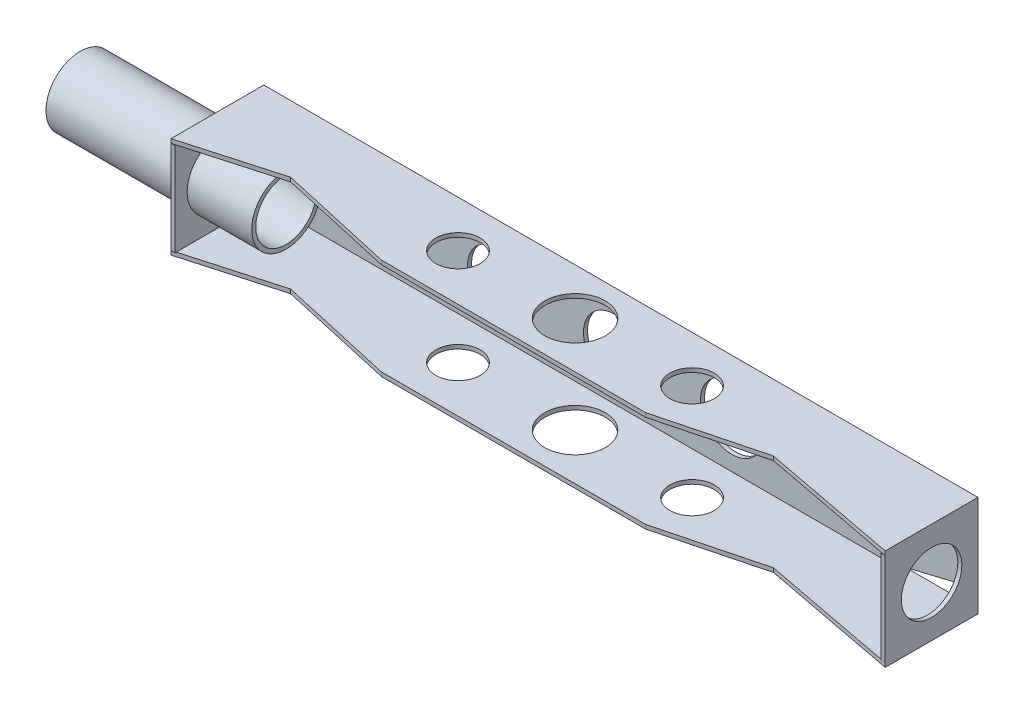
ISO-10303-21;
HEADER;
FILE_DESCRIPTION(('STEP AP214'),'2;1');
FILE_NAME('part.step','',(''),(''),'','','');
FILE_SCHEMA(('AUTOMOTIVE_DESIGN { 1 0 10303 214 1 1 1 1 }'));
ENDSEC;
DATA;
#1=APPLICATION_CONTEXT('core data for automotive mechanical design processes');
#2=APPLICATION_PROTOCOL_DEFINITION('international standard','automotive_design',2000,#1);
#3=PRODUCT_CONTEXT('',#1,'mechanical');
#4=PRODUCT('Part','Part','',(#3));
#5=PRODUCT_RELATED_PRODUCT_CATEGORY('part','',(#4));
#6=PRODUCT_DEFINITION_FORMATION('','',#4);
#7=PRODUCT_DEFINITION_CONTEXT('part definition',#1,'design');
#8=PRODUCT_DEFINITION('design','',#6,#7);
#9=PRODUCT_DEFINITION_SHAPE('','',#8);
#10=(LENGTH_UNIT() NAMED_UNIT(*) SI_UNIT(.MILLI.,.METRE.));
#11=(NAMED_UNIT(*) PLANE_ANGLE_UNIT() SI_UNIT($,.RADIAN.));
#12=(NAMED_UNIT(*) SI_UNIT($,.STERADIAN.) SOLID_ANGLE_UNIT());
#13=UNCERTAINTY_MEASURE_WITH_UNIT(LENGTH_MEASURE(1.E-05),#10,'distance_accuracy_value','');
#14=(GEOMETRIC_REPRESENTATION_CONTEXT(3) GLOBAL_UNCERTAINTY_ASSIGNED_CONTEXT((#13)) GLOBAL_UNIT_ASSIGNED_CONTEXT((#10,
#11,#12)) REPRESENTATION_CONTEXT('',''));
#15=CARTESIAN_POINT('',(0.,0.,0.));
#16=DIRECTION('',(0.,0.,1.));
#17=DIRECTION('',(1.,0.,0.));
#18=AXIS2_PLACEMENT_3D('',#15,#16,#17);
#19=CARTESIAN_POINT('',(0.,0.,0.));
#20=DIRECTION('',(-1.,0.,0.));
#21=DIRECTION('',(0.,0.,1.));
#22=AXIS2_PLACEMENT_3D('',#19,#20,#21);
#23=PLANE('',#22);
#24=DIRECTION('',(0.,-1.,0.));
#25=VECTOR('',#24,1.);
#26=CARTESIAN_POINT('',(0.,0.,2.));
#27=LINE('',#26,#25);
#28=CARTESIAN_POINT('',(0.,46.,2.));
#29=VERTEX_POINT('',#28);
#30=CARTESIAN_POINT('',(0.,0.,2.));
#31=VERTEX_POINT('',#30);
#32=EDGE_CURVE('E488',#29,#31,#27,.T.);
#33=ORIENTED_EDGE('',*,*,#32,.F.);
#34=DIRECTION('',(0.,0.,-1.));
#35=VECTOR('',#34,1.);
#36=CARTESIAN_POINT('',(0.,46.,0.));
#37=LINE('',#36,#35);
#38=CARTESIAN_POINT('',(0.,46.,45.4350722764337));
#39=VERTEX_POINT('',#38);
#40=EDGE_CURVE('E48',#39,#29,#37,.T.);
#41=ORIENTED_EDGE('',*,*,#40,.F.);
#42=DIRECTION('',(0.,0.,-1.));
#43=VECTOR('',#42,1.);
#44=CARTESIAN_POINT('',(0.,46.,0.));
#45=LINE('',#44,#43);
#46=CARTESIAN_POINT('',(0.,46.,46.));
#47=VERTEX_POINT('',#46);
#48=EDGE_CURVE('E436',#47,#39,#45,.T.);
#49=ORIENTED_EDGE('',*,*,#48,.F.);
#50=DIRECTION('',(0.,1.,0.));
#51=VECTOR('',#50,1.);
#52=CARTESIAN_POINT('',(0.,46.,46.));
#53=LINE('',#52,#51);
#54=CARTESIAN_POINT('',(0.,0.,46.));
#55=VERTEX_POINT('',#54);
#56=EDGE_CURVE('E449',#55,#47,#53,.T.);
#57=ORIENTED_EDGE('',*,*,#56,.F.);
#58=DIRECTION('',(0.,0.,1.));
#59=VECTOR('',#58,1.);
#60=CARTESIAN_POINT('',(0.,0.,0.));
#61=LINE('',#60,#59);
#62=CARTESIAN_POINT('',(0.,0.,45.4350722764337));
#63=VERTEX_POINT('',#62);
#64=EDGE_CURVE('E376',#63,#55,#61,.T.);
#65=ORIENTED_EDGE('',*,*,#64,.F.);
#66=EDGE_CURVE('E204',#31,#63,#61,.T.);
#67=ORIENTED_EDGE('',*,*,#66,.F.);
#68=EDGE_LOOP('',(#33,#41,#49,#57,#65,#67));
#69=FACE_BOUND('',#68,.T.);
#70=CARTESIAN_POINT('',(0.,23.,23.));
#71=DIRECTION('',(-1.,0.,0.));
#72=DIRECTION('',(0.,0.,1.));
#73=AXIS2_PLACEMENT_3D('',#70,#71,#72);
#74=CIRCLE('',#73,17.);
#75=CARTESIAN_POINT('',(0.,23.,40.));
#76=VERTEX_POINT('',#75);
#77=EDGE_CURVE('E41',#76,#76,#74,.F.);
#78=ORIENTED_EDGE('',*,*,#77,.F.);
#79=EDGE_LOOP('',(#78));
#80=FACE_BOUND('',#79,.T.);
#81=ADVANCED_FACE('F33',(#69,#80),#23,.F.);
#82=CARTESIAN_POINT('',(0.,0.,2.));
#83=DIRECTION('',(0.,1.,0.));
#84=DIRECTION('',(0.,0.,1.));
#85=AXIS2_PLACEMENT_3D('',#82,#83,#84);
#86=PLANE('',#85);
#87=DIRECTION('',(0.962345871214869,0.,-0.271827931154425));
#88=VECTOR('',#87,1.);
#89=CARTESIAN_POINT('',(-2.,0.,46.));
#90=LINE('',#89,#88);
#91=CARTESIAN_POINT('',(-2.,0.,46.));
#92=VERTEX_POINT('',#91);
#93=EDGE_CURVE('E207',#92,#63,#90,.T.);
#94=ORIENTED_EDGE('',*,*,#93,.T.);
#95=ORIENTED_EDGE('',*,*,#64,.T.);
#96=DIRECTION('',(1.,0.,0.));
#97=VECTOR('',#96,1.);
#98=CARTESIAN_POINT('',(-2.,0.,46.));
#99=LINE('',#98,#97);
#100=EDGE_CURVE('E450',#92,#55,#99,.T.);
#101=ORIENTED_EDGE('',*,*,#100,.F.);
#102=EDGE_LOOP('',(#94,#95,#101));
#103=FACE_BOUND('',#102,.T.);
#104=ADVANCED_FACE('F35',(#103),#86,.F.);
#105=CARTESIAN_POINT('',(352.,0.,0.));
#106=DIRECTION('',(0.,1.,0.));
#107=DIRECTION('',(0.,0.,1.));
#108=AXIS2_PLACEMENT_3D('',#105,#106,#107);
#109=PLANE('',#108);
#110=DIRECTION('',(0.982280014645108,0.,0.187419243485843));
#111=VECTOR('',#110,1.);
#112=CARTESIAN_POINT('',(352.,0.,46.));
#113=LINE('',#112,#111);
#114=CARTESIAN_POINT('',(350.,0.,45.6183995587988));
#115=VERTEX_POINT('',#114);
#116=CARTESIAN_POINT('',(352.,0.,46.));
#117=VERTEX_POINT('',#116);
#118=EDGE_CURVE('E231',#115,#117,#113,.T.);
#119=ORIENTED_EDGE('',*,*,#118,.T.);
#120=DIRECTION('',(-1.,0.,0.));
#121=VECTOR('',#120,1.);
#122=CARTESIAN_POINT('',(352.,0.,46.));
#123=LINE('',#122,#121);
#124=CARTESIAN_POINT('',(350.,0.,46.));
#125=VERTEX_POINT('',#124);
#126=EDGE_CURVE('E357',#117,#125,#123,.T.);
#127=ORIENTED_EDGE('',*,*,#126,.T.);
#128=DIRECTION('',(0.,0.,-1.));
#129=VECTOR('',#128,1.);
#130=CARTESIAN_POINT('',(350.,0.,0.));
#131=LINE('',#130,#129);
#132=EDGE_CURVE('E348',#125,#115,#131,.T.);
#133=ORIENTED_EDGE('',*,*,#132,.T.);
#134=EDGE_LOOP('',(#119,#127,#133));
#135=FACE_BOUND('',#134,.T.);
#136=ADVANCED_FACE('F396',(#135),#109,.F.);
#137=CARTESIAN_POINT('',(0.,46.,2.));
#138=DIRECTION('',(0.,-1.,0.));
#139=DIRECTION('',(0.,0.,-1.));
#140=AXIS2_PLACEMENT_3D('',#137,#138,#139);
#141=PLANE('',#140);
#142=DIRECTION('',(0.962345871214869,0.,-0.271827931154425));
#143=VECTOR('',#142,1.);
#144=CARTESIAN_POINT('',(-2.,46.,46.));
#145=LINE('',#144,#143);
#146=CARTESIAN_POINT('',(-2.,46.,46.));
#147=VERTEX_POINT('',#146);
#148=EDGE_CURVE('E310',#147,#39,#145,.T.);
#149=ORIENTED_EDGE('',*,*,#148,.F.);
#150=DIRECTION('',(1.,0.,0.));
#151=VECTOR('',#150,1.);
#152=CARTESIAN_POINT('',(-2.,46.,46.));
#153=LINE('',#152,#151);
#154=EDGE_CURVE('E435',#147,#47,#153,.T.);
#155=ORIENTED_EDGE('',*,*,#154,.T.);
#156=ORIENTED_EDGE('',*,*,#48,.T.);
#157=EDGE_LOOP('',(#149,#155,#156));
#158=FACE_BOUND('',#157,.T.);
#159=ADVANCED_FACE('F433',(#158),#141,.F.);
#160=CARTESIAN_POINT('',(352.,46.,46.));
#161=DIRECTION('',(0.,-1.,0.));
#162=DIRECTION('',(0.,0.,-1.));
#163=AXIS2_PLACEMENT_3D('',#160,#161,#162);
#164=PLANE('',#163);
#165=DIRECTION('',(0.982280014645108,0.,0.187419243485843));
#166=VECTOR('',#165,1.);
#167=CARTESIAN_POINT('',(352.,46.,46.));
#168=LINE('',#167,#166);
#169=CARTESIAN_POINT('',(350.,46.,45.6183995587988));
#170=VERTEX_POINT('',#169);
#171=CARTESIAN_POINT('',(352.,46.,46.));
#172=VERTEX_POINT('',#171);
#173=EDGE_CURVE('E56',#170,#172,#168,.T.);
#174=ORIENTED_EDGE('',*,*,#173,.F.);
#175=DIRECTION('',(0.,0.,1.));
#176=VECTOR('',#175,1.);
#177=CARTESIAN_POINT('',(350.,46.,46.));
#178=LINE('',#177,#176);
#179=CARTESIAN_POINT('',(350.,46.,46.));
#180=VERTEX_POINT('',#179);
#181=EDGE_CURVE('E372',#170,#180,#178,.T.);
#182=ORIENTED_EDGE('',*,*,#181,.T.);
#183=DIRECTION('',(-1.,0.,0.));
#184=VECTOR('',#183,1.);
#185=CARTESIAN_POINT('',(352.,46.,46.));
#186=LINE('',#185,#184);
#187=EDGE_CURVE('E373',#172,#180,#186,.T.);
#188=ORIENTED_EDGE('',*,*,#187,.F.);
#189=EDGE_LOOP('',(#174,#182,#188));
#190=FACE_BOUND('',#189,.T.);
#191=ADVANCED_FACE('F385',(#190),#164,.F.);
#192=CARTESIAN_POINT('',(0.,46.,2.));
#193=DIRECTION('',(0.,0.,-1.));
#194=DIRECTION('',(-1.,0.,0.));
#195=AXIS2_PLACEMENT_3D('',#192,#193,#194);
#196=PLANE('',#195);
#197=CARTESIAN_POINT('',(290.,23.,2.));
#198=DIRECTION('',(0.,0.,1.));
#199=DIRECTION('',(1.,0.,0.));
#200=AXIS2_PLACEMENT_3D('',#197,#198,#199);
#201=CIRCLE('',#200,9.43947184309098);
#202=CARTESIAN_POINT('',(299.439471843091,23.,2.));
#203=VERTEX_POINT('',#202);
#204=EDGE_CURVE('E620',#203,#203,#201,.T.);
#205=ORIENTED_EDGE('',*,*,#204,.F.);
#206=EDGE_LOOP('',(#205));
#207=FACE_BOUND('',#206,.T.);
#208=CARTESIAN_POINT('',(174.,23.,2.));
#209=DIRECTION('',(0.,0.,1.));
#210=DIRECTION('',(1.,0.,0.));
#211=AXIS2_PLACEMENT_3D('',#208,#209,#210);
#212=CIRCLE('',#211,15.5650293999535);
#213=CARTESIAN_POINT('',(189.565029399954,23.,2.));
#214=VERTEX_POINT('',#213);
#215=EDGE_CURVE('E630',#214,#214,#212,.T.);
#216=ORIENTED_EDGE('',*,*,#215,.F.);
#217=EDGE_LOOP('',(#216));
#218=FACE_BOUND('',#217,.T.);
#219=ORIENTED_EDGE('',*,*,#32,.T.);
#220=DIRECTION('',(1.,0.,0.));
#221=VECTOR('',#220,1.);
#222=CARTESIAN_POINT('',(0.,0.,2.));
#223=LINE('',#222,#221);
#224=CARTESIAN_POINT('',(309.788272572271,0.,2.));
#225=VERTEX_POINT('',#224);
#226=EDGE_CURVE('E485',#31,#225,#223,.T.);
#227=ORIENTED_EDGE('',*,*,#226,.T.);
#228=DIRECTION('',(0.972344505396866,0.233551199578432,0.));
#229=VECTOR('',#228,1.);
#230=CARTESIAN_POINT('',(309.788272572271,0.,2.));
#231=LINE('',#230,#229);
#232=CARTESIAN_POINT('',(350.,9.65861083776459,2.));
#233=VERTEX_POINT('',#232);
#234=EDGE_CURVE('E487',#225,#233,#231,.T.);
#235=ORIENTED_EDGE('',*,*,#234,.T.);
#236=DIRECTION('',(0.,1.,0.));
#237=VECTOR('',#236,1.);
#238=CARTESIAN_POINT('',(350.,9.65861083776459,2.));
#239=LINE('',#238,#237);
#240=CARTESIAN_POINT('',(350.,34.495038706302,2.));
#241=VERTEX_POINT('',#240);
#242=EDGE_CURVE('E503',#233,#241,#239,.T.);
#243=ORIENTED_EDGE('',*,*,#242,.T.);
#244=DIRECTION('',(-0.96142348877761,0.275072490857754,0.));
#245=VECTOR('',#244,1.);
#246=CARTESIAN_POINT('',(309.788272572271,46.,2.));
#247=LINE('',#246,#245);
#248=CARTESIAN_POINT('',(309.788272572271,46.,2.));
#249=VERTEX_POINT('',#248);
#250=EDGE_CURVE('E505',#241,#249,#247,.T.);
#251=ORIENTED_EDGE('',*,*,#250,.T.);
#252=DIRECTION('',(-1.,0.,0.));
#253=VECTOR('',#252,1.);
#254=CARTESIAN_POINT('',(0.,46.,2.));
#255=LINE('',#254,#253);
#256=EDGE_CURVE('E495',#249,#29,#255,.T.);
#257=ORIENTED_EDGE('',*,*,#256,.T.);
#258=EDGE_LOOP('',(#219,#227,#235,#243,#251,#257));
#259=FACE_BOUND('',#258,.T.);
#260=CARTESIAN_POINT('',(116.,23.,2.));
#261=DIRECTION('',(0.,0.,1.));
#262=DIRECTION('',(1.,0.,0.));
#263=AXIS2_PLACEMENT_3D('',#260,#261,#262);
#264=CIRCLE('',#263,15.);
#265=CARTESIAN_POINT('',(131.,23.,2.));
#266=VERTEX_POINT('',#265);
#267=EDGE_CURVE('E594',#266,#266,#264,.T.);
#268=ORIENTED_EDGE('',*,*,#267,.F.);
#269=EDGE_LOOP('',(#268));
#270=FACE_BOUND('',#269,.T.);
#271=CARTESIAN_POINT('',(232.,23.,2.));
#272=DIRECTION('',(0.,0.,1.));
#273=DIRECTION('',(1.,0.,0.));
#274=AXIS2_PLACEMENT_3D('',#271,#272,#273);
#275=CIRCLE('',#274,15.5650293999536);
#276=CARTESIAN_POINT('',(247.565029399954,23.,2.));
#277=VERTEX_POINT('',#276);
#278=EDGE_CURVE('E625',#277,#277,#275,.T.);
#279=ORIENTED_EDGE('',*,*,#278,.F.);
#280=EDGE_LOOP('',(#279));
#281=FACE_BOUND('',#280,.T.);
#282=CARTESIAN_POINT('',(58.,23.,2.));
#283=DIRECTION('',(0.,0.,1.));
#284=DIRECTION('',(1.,0.,0.));
#285=AXIS2_PLACEMENT_3D('',#282,#283,#284);
#286=CIRCLE('',#285,11.0384123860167);
#287=CARTESIAN_POINT('',(69.0384123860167,23.,2.));
#288=VERTEX_POINT('',#287);
#289=EDGE_CURVE('E461',#288,#288,#286,.T.);
#290=ORIENTED_EDGE('',*,*,#289,.F.);
#291=EDGE_LOOP('',(#290));
#292=FACE_BOUND('',#291,.T.);
#293=ADVANCED_FACE('F511',(#207,#218,#259,#270,#281,#292),#196,.F.);
#294=CARTESIAN_POINT('',(0.,46.,0.));
#295=DIRECTION('',(0.,0.,-1.));
#296=DIRECTION('',(-1.,0.,0.));
#297=AXIS2_PLACEMENT_3D('',#294,#295,#296);
#298=PLANE('',#297);
#299=DIRECTION('',(0.972344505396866,0.233551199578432,0.));
#300=VECTOR('',#299,1.);
#301=CARTESIAN_POINT('',(309.788272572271,0.,0.));
#302=LINE('',#301,#300);
#303=CARTESIAN_POINT('',(309.788272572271,0.,0.));
#304=VERTEX_POINT('',#303);
#305=CARTESIAN_POINT('',(350.,9.65861083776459,0.));
#306=VERTEX_POINT('',#305);
#307=EDGE_CURVE('E592',#304,#306,#302,.T.);
#308=ORIENTED_EDGE('',*,*,#307,.F.);
#309=DIRECTION('',(-1.,0.,0.));
#310=VECTOR('',#309,1.);
#311=CARTESIAN_POINT('',(-2.,0.,0.));
#312=LINE('',#311,#310);
#313=CARTESIAN_POINT('',(350.,0.,0.));
#314=VERTEX_POINT('',#313);
#315=EDGE_CURVE('E235',#314,#304,#312,.T.);
#316=ORIENTED_EDGE('',*,*,#315,.F.);
#317=DIRECTION('',(0.,1.,0.));
#318=VECTOR('',#317,1.);
#319=CARTESIAN_POINT('',(350.,34.495038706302,0.));
#320=LINE('',#319,#318);
#321=EDGE_CURVE('E369',#314,#306,#320,.T.);
#322=ORIENTED_EDGE('',*,*,#321,.T.);
#323=EDGE_LOOP('',(#308,#316,#322));
#324=FACE_BOUND('',#323,.T.);
#325=DIRECTION('',(0.,-1.,0.));
#326=VECTOR('',#325,1.);
#327=CARTESIAN_POINT('',(-2.,46.,0.));
#328=LINE('',#327,#326);
#329=CARTESIAN_POINT('',(-2.,48.,0.));
#330=VERTEX_POINT('',#329);
#331=CARTESIAN_POINT('',(-2.,-2.,0.));
#332=VERTEX_POINT('',#331);
#333=EDGE_CURVE('E445',#330,#332,#328,.T.);
#334=ORIENTED_EDGE('',*,*,#333,.F.);
#335=DIRECTION('',(-1.,0.,0.));
#336=VECTOR('',#335,1.);
#337=CARTESIAN_POINT('',(-2.,48.,0.));
#338=LINE('',#337,#336);
#339=CARTESIAN_POINT('',(352.,48.,0.));
#340=VERTEX_POINT('',#339);
#341=EDGE_CURVE('E306',#340,#330,#338,.T.);
#342=ORIENTED_EDGE('',*,*,#341,.F.);
#343=DIRECTION('',(0.,1.,0.));
#344=VECTOR('',#343,1.);
#345=CARTESIAN_POINT('',(352.,0.,0.));
#346=LINE('',#345,#344);
#347=CARTESIAN_POINT('',(352.,-2.,0.));
#348=VERTEX_POINT('',#347);
#349=EDGE_CURVE('E351',#348,#340,#346,.T.);
#350=ORIENTED_EDGE('',*,*,#349,.F.);
#351=DIRECTION('',(-1.,0.,0.));
#352=VECTOR('',#351,1.);
#353=CARTESIAN_POINT('',(-2.,-2.,0.));
#354=LINE('',#353,#352);
#355=EDGE_CURVE('E208',#348,#332,#354,.T.);
#356=ORIENTED_EDGE('',*,*,#355,.T.);
#357=EDGE_LOOP('',(#334,#342,#350,#356));
#358=FACE_BOUND('',#357,.T.);
#359=CARTESIAN_POINT('',(290.,23.,0.));
#360=DIRECTION('',(0.,0.,1.));
#361=DIRECTION('',(1.,0.,0.));
#362=AXIS2_PLACEMENT_3D('',#359,#360,#361);
#363=CIRCLE('',#362,9.43947184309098);
#364=CARTESIAN_POINT('',(299.439471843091,23.,0.));
#365=VERTEX_POINT('',#364);
#366=EDGE_CURVE('E618',#365,#365,#363,.T.);
#367=ORIENTED_EDGE('',*,*,#366,.T.);
#368=EDGE_LOOP('',(#367));
#369=FACE_BOUND('',#368,.T.);
#370=CARTESIAN_POINT('',(174.,23.,0.));
#371=DIRECTION('',(0.,0.,1.));
#372=DIRECTION('',(1.,0.,0.));
#373=AXIS2_PLACEMENT_3D('',#370,#371,#372);
#374=CIRCLE('',#373,15.5650293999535);
#375=CARTESIAN_POINT('',(189.565029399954,23.,0.));
#376=VERTEX_POINT('',#375);
#377=EDGE_CURVE('E628',#376,#376,#374,.T.);
#378=ORIENTED_EDGE('',*,*,#377,.T.);
#379=EDGE_LOOP('',(#378));
#380=FACE_BOUND('',#379,.T.);
#381=DIRECTION('',(-1.,0.,0.));
#382=VECTOR('',#381,1.);
#383=CARTESIAN_POINT('',(-2.,46.,0.));
#384=LINE('',#383,#382);
#385=CARTESIAN_POINT('',(350.,46.,0.));
#386=VERTEX_POINT('',#385);
#387=CARTESIAN_POINT('',(309.788272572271,46.,0.));
#388=VERTEX_POINT('',#387);
#389=EDGE_CURVE('E293',#386,#388,#384,.T.);
#390=ORIENTED_EDGE('',*,*,#389,.T.);
#391=DIRECTION('',(-0.96142348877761,0.275072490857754,0.));
#392=VECTOR('',#391,1.);
#393=CARTESIAN_POINT('',(309.788272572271,46.,0.));
#394=LINE('',#393,#392);
#395=CARTESIAN_POINT('',(350.,34.495038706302,0.));
#396=VERTEX_POINT('',#395);
#397=EDGE_CURVE('E494',#396,#388,#394,.T.);
#398=ORIENTED_EDGE('',*,*,#397,.F.);
#399=EDGE_CURVE('E360',#396,#386,#320,.T.);
#400=ORIENTED_EDGE('',*,*,#399,.T.);
#401=EDGE_LOOP('',(#390,#398,#400));
#402=FACE_BOUND('',#401,.T.);
#403=CARTESIAN_POINT('',(116.,23.,0.));
#404=DIRECTION('',(0.,0.,1.));
#405=DIRECTION('',(1.,0.,0.));
#406=AXIS2_PLACEMENT_3D('',#403,#404,#405);
#407=CIRCLE('',#406,15.);
#408=CARTESIAN_POINT('',(131.,23.,0.));
#409=VERTEX_POINT('',#408);
#410=EDGE_CURVE('E500',#409,#409,#407,.T.);
#411=ORIENTED_EDGE('',*,*,#410,.T.);
#412=EDGE_LOOP('',(#411));
#413=FACE_BOUND('',#412,.T.);
#414=CARTESIAN_POINT('',(232.,23.,0.));
#415=DIRECTION('',(0.,0.,1.));
#416=DIRECTION('',(1.,0.,0.));
#417=AXIS2_PLACEMENT_3D('',#414,#415,#416);
#418=CIRCLE('',#417,15.5650293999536);
#419=CARTESIAN_POINT('',(247.565029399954,23.,0.));
#420=VERTEX_POINT('',#419);
#421=EDGE_CURVE('E613',#420,#420,#418,.T.);
#422=ORIENTED_EDGE('',*,*,#421,.T.);
#423=EDGE_LOOP('',(#422));
#424=FACE_BOUND('',#423,.T.);
#425=CARTESIAN_POINT('',(58.,23.,0.));
#426=DIRECTION('',(0.,0.,1.));
#427=DIRECTION('',(1.,0.,0.));
#428=AXIS2_PLACEMENT_3D('',#425,#426,#427);
#429=CIRCLE('',#428,11.0384123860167);
#430=CARTESIAN_POINT('',(69.0384123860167,23.,0.));
#431=VERTEX_POINT('',#430);
#432=EDGE_CURVE('E452',#431,#431,#429,.T.);
#433=ORIENTED_EDGE('',*,*,#432,.T.);
#434=EDGE_LOOP('',(#433));
#435=FACE_BOUND('',#434,.T.);
#436=ADVANCED_FACE('F578',(#324,#358,#369,#380,#402,#413,#424,#435),#298,.T.);
#437=CARTESIAN_POINT('',(309.788272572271,0.,2.));
#438=DIRECTION('',(-0.233551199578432,0.972344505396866,0.));
#439=DIRECTION('',(-0.972344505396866,-0.233551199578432,0.));
#440=AXIS2_PLACEMENT_3D('',#437,#438,#439);
#441=PLANE('',#440);
#442=ORIENTED_EDGE('',*,*,#307,.T.);
#443=DIRECTION('',(0.,0.,-1.));
#444=VECTOR('',#443,1.);
#445=CARTESIAN_POINT('',(350.,9.65861083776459,2.));
#446=LINE('',#445,#444);
#447=EDGE_CURVE('E473',#233,#306,#446,.T.);
#448=ORIENTED_EDGE('',*,*,#447,.F.);
#449=ORIENTED_EDGE('',*,*,#234,.F.);
#450=DIRECTION('',(0.,0.,-1.));
#451=VECTOR('',#450,1.);
#452=CARTESIAN_POINT('',(309.788272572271,0.,2.));
#453=LINE('',#452,#451);
#454=EDGE_CURVE('E470',#225,#304,#453,.T.);
#455=ORIENTED_EDGE('',*,*,#454,.T.);
#456=EDGE_LOOP('',(#442,#448,#449,#455));
#457=FACE_BOUND('',#456,.T.);
#458=ADVANCED_FACE('F582',(#457),#441,.F.);
#459=CARTESIAN_POINT('',(309.788272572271,46.,2.));
#460=DIRECTION('',(-0.275072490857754,-0.96142348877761,0.));
#461=DIRECTION('',(0.96142348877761,-0.275072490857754,0.));
#462=AXIS2_PLACEMENT_3D('',#459,#460,#461);
#463=PLANE('',#462);
#464=ORIENTED_EDGE('',*,*,#397,.T.);
#465=DIRECTION('',(0.,0.,-1.));
#466=VECTOR('',#465,1.);
#467=CARTESIAN_POINT('',(309.788272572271,46.,2.));
#468=LINE('',#467,#466);
#469=EDGE_CURVE('E506',#249,#388,#468,.T.);
#470=ORIENTED_EDGE('',*,*,#469,.F.);
#471=ORIENTED_EDGE('',*,*,#250,.F.);
#472=DIRECTION('',(0.,0.,-1.));
#473=VECTOR('',#472,1.);
#474=CARTESIAN_POINT('',(350.,34.495038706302,2.));
#475=LINE('',#474,#473);
#476=EDGE_CURVE('E479',#241,#396,#475,.T.);
#477=ORIENTED_EDGE('',*,*,#476,.T.);
#478=EDGE_LOOP('',(#464,#470,#471,#477));
#479=FACE_BOUND('',#478,.T.);
#480=ADVANCED_FACE('F574',(#479),#463,.F.);
#481=CARTESIAN_POINT('',(116.,23.,2.));
#482=DIRECTION('',(0.,0.,-1.));
#483=DIRECTION('',(-1.,0.,0.));
#484=AXIS2_PLACEMENT_3D('',#481,#482,#483);
#485=CYLINDRICAL_SURFACE('',#484,15.);
#486=ORIENTED_EDGE('',*,*,#267,.T.);
#487=EDGE_LOOP('',(#486));
#488=FACE_BOUND('',#487,.T.);
#489=ORIENTED_EDGE('',*,*,#410,.F.);
#490=EDGE_LOOP('',(#489));
#491=FACE_BOUND('',#490,.T.);
#492=ADVANCED_FACE('F570',(#488,#491),#485,.F.);
#493=CARTESIAN_POINT('',(174.,23.,2.));
#494=DIRECTION('',(0.,0.,-1.));
#495=DIRECTION('',(-1.,0.,0.));
#496=AXIS2_PLACEMENT_3D('',#493,#494,#495);
#497=CYLINDRICAL_SURFACE('',#496,15.5650293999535);
#498=ORIENTED_EDGE('',*,*,#215,.T.);
#499=EDGE_LOOP('',(#498));
#500=FACE_BOUND('',#499,.T.);
#501=ORIENTED_EDGE('',*,*,#377,.F.);
#502=EDGE_LOOP('',(#501));
#503=FACE_BOUND('',#502,.T.);
#504=ADVANCED_FACE('F566',(#500,#503),#497,.F.);
#505=CARTESIAN_POINT('',(232.,23.,2.));
#506=DIRECTION('',(0.,0.,-1.));
#507=DIRECTION('',(-1.,0.,0.));
#508=AXIS2_PLACEMENT_3D('',#505,#506,#507);
#509=CYLINDRICAL_SURFACE('',#508,15.5650293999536);
#510=ORIENTED_EDGE('',*,*,#278,.T.);
#511=EDGE_LOOP('',(#510));
#512=FACE_BOUND('',#511,.T.);
#513=ORIENTED_EDGE('',*,*,#421,.F.);
#514=EDGE_LOOP('',(#513));
#515=FACE_BOUND('',#514,.T.);
#516=ADVANCED_FACE('F562',(#512,#515),#509,.F.);
#517=CARTESIAN_POINT('',(290.,23.,2.));
#518=DIRECTION('',(0.,0.,-1.));
#519=DIRECTION('',(-1.,0.,0.));
#520=AXIS2_PLACEMENT_3D('',#517,#518,#519);
#521=CYLINDRICAL_SURFACE('',#520,9.43947184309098);
#522=ORIENTED_EDGE('',*,*,#204,.T.);
#523=EDGE_LOOP('',(#522));
#524=FACE_BOUND('',#523,.T.);
#525=ORIENTED_EDGE('',*,*,#366,.F.);
#526=EDGE_LOOP('',(#525));
#527=FACE_BOUND('',#526,.T.);
#528=ADVANCED_FACE('F558',(#524,#527),#521,.F.);
#529=CARTESIAN_POINT('',(58.,23.,2.));
#530=DIRECTION('',(0.,0.,-1.));
#531=DIRECTION('',(-1.,0.,0.));
#532=AXIS2_PLACEMENT_3D('',#529,#530,#531);
#533=CYLINDRICAL_SURFACE('',#532,11.0384123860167);
#534=ORIENTED_EDGE('',*,*,#289,.T.);
#535=EDGE_LOOP('',(#534));
#536=FACE_BOUND('',#535,.T.);
#537=ORIENTED_EDGE('',*,*,#432,.F.);
#538=EDGE_LOOP('',(#537));
#539=FACE_BOUND('',#538,.T.);
#540=ADVANCED_FACE('F555',(#536,#539),#533,.F.);
#541=CARTESIAN_POINT('',(-2.,0.,0.));
#542=DIRECTION('',(-1.,0.,0.));
#543=DIRECTION('',(0.,0.,1.));
#544=AXIS2_PLACEMENT_3D('',#541,#542,#543);
#545=PLANE('',#544);
#546=CARTESIAN_POINT('',(-2.,23.,23.));
#547=DIRECTION('',(-1.,0.,0.));
#548=DIRECTION('',(0.,0.,1.));
#549=AXIS2_PLACEMENT_3D('',#546,#547,#548);
#550=CIRCLE('',#549,17.);
#551=CARTESIAN_POINT('',(-2.,23.,40.));
#552=VERTEX_POINT('',#551);
#553=EDGE_CURVE('E11',#552,#552,#550,.T.);
#554=ORIENTED_EDGE('',*,*,#553,.F.);
#555=EDGE_LOOP('',(#554));
#556=FACE_BOUND('',#555,.T.);
#557=ORIENTED_EDGE('',*,*,#333,.T.);
#558=DIRECTION('',(0.,0.,1.));
#559=VECTOR('',#558,1.);
#560=CARTESIAN_POINT('',(-2.,-2.,0.));
#561=LINE('',#560,#559);
#562=CARTESIAN_POINT('',(-2.,-2.,46.));
#563=VERTEX_POINT('',#562);
#564=EDGE_CURVE('E239',#332,#563,#561,.T.);
#565=ORIENTED_EDGE('',*,*,#564,.T.);
#566=DIRECTION('',(0.,-1.,0.));
#567=VECTOR('',#566,1.);
#568=CARTESIAN_POINT('',(-2.,0.,46.));
#569=LINE('',#568,#567);
#570=EDGE_CURVE('E217',#92,#563,#569,.T.);
#571=ORIENTED_EDGE('',*,*,#570,.F.);
#572=DIRECTION('',(0.,1.,0.));
#573=VECTOR('',#572,1.);
#574=CARTESIAN_POINT('',(-2.,46.,46.));
#575=LINE('',#574,#573);
#576=EDGE_CURVE('E440',#92,#147,#575,.T.);
#577=ORIENTED_EDGE('',*,*,#576,.T.);
#578=DIRECTION('',(0.,-1.,0.));
#579=VECTOR('',#578,1.);
#580=CARTESIAN_POINT('',(-2.,48.,46.));
#581=LINE('',#580,#579);
#582=CARTESIAN_POINT('',(-2.,48.,46.));
#583=VERTEX_POINT('',#582);
#584=EDGE_CURVE('E338',#583,#147,#581,.T.);
#585=ORIENTED_EDGE('',*,*,#584,.F.);
#586=DIRECTION('',(0.,0.,1.));
#587=VECTOR('',#586,1.);
#588=CARTESIAN_POINT('',(-2.,48.,0.));
#589=LINE('',#588,#587);
#590=EDGE_CURVE('E289',#330,#583,#589,.T.);
#591=ORIENTED_EDGE('',*,*,#590,.F.);
#592=EDGE_LOOP('',(#557,#565,#571,#577,#585,#591));
#593=FACE_BOUND('',#592,.T.);
#594=ADVANCED_FACE('F441',(#556,#593),#545,.T.);
#595=CARTESIAN_POINT('',(-2.,46.,46.));
#596=DIRECTION('',(0.,0.,-1.));
#597=DIRECTION('',(0.,1.,0.));
#598=AXIS2_PLACEMENT_3D('',#595,#596,#597);
#599=PLANE('',#598);
#600=ORIENTED_EDGE('',*,*,#56,.T.);
#601=ORIENTED_EDGE('',*,*,#154,.F.);
#602=ORIENTED_EDGE('',*,*,#576,.F.);
#603=ORIENTED_EDGE('',*,*,#100,.T.);
#604=EDGE_LOOP('',(#600,#601,#602,#603));
#605=FACE_BOUND('',#604,.T.);
#606=ADVANCED_FACE('F447',(#605),#599,.F.);
#607=CARTESIAN_POINT('',(-2.,23.,23.));
#608=DIRECTION('',(1.,0.,0.));
#609=DIRECTION('',(0.,0.,-1.));
#610=AXIS2_PLACEMENT_3D('',#607,#608,#609);
#611=CYLINDRICAL_SURFACE('',#610,15.);
#612=CARTESIAN_POINT('',(32.,23.,23.));
#613=DIRECTION('',(1.,0.,0.));
#614=DIRECTION('',(0.,0.,-1.));
#615=AXIS2_PLACEMENT_3D('',#612,#613,#614);
#616=CIRCLE('',#615,15.);
#617=CARTESIAN_POINT('',(32.,23.,8.00000000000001));
#618=VERTEX_POINT('',#617);
#619=EDGE_CURVE('E718',#618,#618,#616,.T.);
#620=ORIENTED_EDGE('',*,*,#619,.T.);
#621=EDGE_LOOP('',(#620));
#622=FACE_BOUND('',#621,.T.);
#623=CARTESIAN_POINT('',(-70.,23.,23.));
#624=DIRECTION('',(1.,0.,0.));
#625=DIRECTION('',(0.,0.,-1.));
#626=AXIS2_PLACEMENT_3D('',#623,#624,#625);
#627=CIRCLE('',#626,15.);
#628=CARTESIAN_POINT('',(-70.,23.,8.00000000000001));
#629=VERTEX_POINT('',#628);
#630=EDGE_CURVE('E721',#629,#629,#627,.T.);
#631=ORIENTED_EDGE('',*,*,#630,.F.);
#632=EDGE_LOOP('',(#631));
#633=FACE_BOUND('',#632,.T.);
#634=ADVANCED_FACE('F554',(#622,#633),#611,.F.);
#635=CARTESIAN_POINT('',(350.,0.,46.));
#636=DIRECTION('',(-1.,0.,0.));
#637=DIRECTION('',(0.,0.,1.));
#638=AXIS2_PLACEMENT_3D('',#635,#636,#637);
#639=PLANE('',#638);
#640=CARTESIAN_POINT('',(350.,23.,23.));
#641=DIRECTION('',(1.,0.,0.));
#642=DIRECTION('',(0.,0.,-1.));
#643=AXIS2_PLACEMENT_3D('',#640,#641,#642);
#644=CIRCLE('',#643,15.);
#645=CARTESIAN_POINT('',(350.,23.,8.00000000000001));
#646=VERTEX_POINT('',#645);
#647=EDGE_CURVE('E342',#646,#646,#644,.T.);
#648=ORIENTED_EDGE('',*,*,#647,.T.);
#649=EDGE_LOOP('',(#648));
#650=FACE_BOUND('',#649,.T.);
#651=ORIENTED_EDGE('',*,*,#476,.F.);
#652=ORIENTED_EDGE('',*,*,#242,.F.);
#653=ORIENTED_EDGE('',*,*,#447,.T.);
#654=ORIENTED_EDGE('',*,*,#321,.F.);
#655=DIRECTION('',(0.,0.,-1.));
#656=VECTOR('',#655,1.);
#657=CARTESIAN_POINT('',(350.,0.,46.));
#658=LINE('',#657,#656);
#659=EDGE_CURVE('E267',#115,#314,#658,.T.);
#660=ORIENTED_EDGE('',*,*,#659,.F.);
#661=ORIENTED_EDGE('',*,*,#132,.F.);
#662=DIRECTION('',(0.,-1.,0.));
#663=VECTOR('',#662,1.);
#664=CARTESIAN_POINT('',(350.,0.,46.));
#665=LINE('',#664,#663);
#666=EDGE_CURVE('E354',#180,#125,#665,.T.);
#667=ORIENTED_EDGE('',*,*,#666,.F.);
#668=ORIENTED_EDGE('',*,*,#181,.F.);
#669=EDGE_CURVE('E363',#386,#170,#178,.T.);
#670=ORIENTED_EDGE('',*,*,#669,.F.);
#671=ORIENTED_EDGE('',*,*,#399,.F.);
#672=EDGE_LOOP('',(#651,#652,#653,#654,#660,#661,#667,#668,#670,#671));
#673=FACE_BOUND('',#672,.T.);
#674=ADVANCED_FACE('F391',(#650,#673),#639,.T.);
#675=CARTESIAN_POINT('',(352.,0.,46.));
#676=DIRECTION('',(-1.,0.,0.));
#677=DIRECTION('',(0.,0.,1.));
#678=AXIS2_PLACEMENT_3D('',#675,#676,#677);
#679=PLANE('',#678);
#680=DIRECTION('',(0.,-1.,0.));
#681=VECTOR('',#680,1.);
#682=CARTESIAN_POINT('',(352.,0.,46.));
#683=LINE('',#682,#681);
#684=EDGE_CURVE('E353',#172,#117,#683,.T.);
#685=ORIENTED_EDGE('',*,*,#684,.T.);
#686=DIRECTION('',(0.,-1.,0.));
#687=VECTOR('',#686,1.);
#688=CARTESIAN_POINT('',(352.,0.,46.));
#689=LINE('',#688,#687);
#690=CARTESIAN_POINT('',(352.,-2.,46.));
#691=VERTEX_POINT('',#690);
#692=EDGE_CURVE('E238',#117,#691,#689,.T.);
#693=ORIENTED_EDGE('',*,*,#692,.T.);
#694=DIRECTION('',(0.,0.,-1.));
#695=VECTOR('',#694,1.);
#696=CARTESIAN_POINT('',(352.,-2.,0.));
#697=LINE('',#696,#695);
#698=EDGE_CURVE('E252',#691,#348,#697,.T.);
#699=ORIENTED_EDGE('',*,*,#698,.T.);
#700=ORIENTED_EDGE('',*,*,#349,.T.);
#701=DIRECTION('',(0.,0.,-1.));
#702=VECTOR('',#701,1.);
#703=CARTESIAN_POINT('',(352.,48.,0.));
#704=LINE('',#703,#702);
#705=CARTESIAN_POINT('',(352.,48.,46.));
#706=VERTEX_POINT('',#705);
#707=EDGE_CURVE('E303',#706,#340,#704,.T.);
#708=ORIENTED_EDGE('',*,*,#707,.F.);
#709=DIRECTION('',(0.,-1.,0.));
#710=VECTOR('',#709,1.);
#711=CARTESIAN_POINT('',(352.,48.,46.));
#712=LINE('',#711,#710);
#713=EDGE_CURVE('E309',#706,#172,#712,.T.);
#714=ORIENTED_EDGE('',*,*,#713,.T.);
#715=EDGE_LOOP('',(#685,#693,#699,#700,#708,#714));
#716=FACE_BOUND('',#715,.T.);
#717=CARTESIAN_POINT('',(352.,23.,23.));
#718=DIRECTION('',(1.,0.,0.));
#719=DIRECTION('',(0.,0.,-1.));
#720=AXIS2_PLACEMENT_3D('',#717,#718,#719);
#721=CIRCLE('',#720,15.);
#722=CARTESIAN_POINT('',(352.,23.,8.00000000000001));
#723=VERTEX_POINT('',#722);
#724=EDGE_CURVE('E345',#723,#723,#721,.T.);
#725=ORIENTED_EDGE('',*,*,#724,.F.);
#726=EDGE_LOOP('',(#725));
#727=FACE_BOUND('',#726,.T.);
#728=ADVANCED_FACE('F400',(#716,#727),#679,.F.);
#729=CARTESIAN_POINT('',(352.,0.,46.));
#730=DIRECTION('',(0.,0.,-1.));
#731=DIRECTION('',(0.,1.,0.));
#732=AXIS2_PLACEMENT_3D('',#729,#730,#731);
#733=PLANE('',#732);
#734=ORIENTED_EDGE('',*,*,#666,.T.);
#735=ORIENTED_EDGE('',*,*,#126,.F.);
#736=ORIENTED_EDGE('',*,*,#684,.F.);
#737=ORIENTED_EDGE('',*,*,#187,.T.);
#738=EDGE_LOOP('',(#734,#735,#736,#737));
#739=FACE_BOUND('',#738,.T.);
#740=ADVANCED_FACE('F388',(#739),#733,.F.);
#741=CARTESIAN_POINT('',(352.,23.,23.));
#742=DIRECTION('',(-1.,0.,0.));
#743=DIRECTION('',(0.,0.,1.));
#744=AXIS2_PLACEMENT_3D('',#741,#742,#743);
#745=CYLINDRICAL_SURFACE('',#744,15.);
#746=ORIENTED_EDGE('',*,*,#724,.T.);
#747=EDGE_LOOP('',(#746));
#748=FACE_BOUND('',#747,.T.);
#749=ORIENTED_EDGE('',*,*,#647,.F.);
#750=EDGE_LOOP('',(#749));
#751=FACE_BOUND('',#750,.T.);
#752=ADVANCED_FACE('F671',(#748,#751),#745,.F.);
#753=CARTESIAN_POINT('',(-2.,46.,46.));
#754=DIRECTION('',(0.,1.,0.));
#755=DIRECTION('',(0.,0.,1.));
#756=AXIS2_PLACEMENT_3D('',#753,#754,#755);
#757=PLANE('',#756);
#758=CARTESIAN_POINT('',(233.266381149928,46.,23.));
#759=DIRECTION('',(0.,1.,0.));
#760=DIRECTION('',(0.,0.,1.));
#761=AXIS2_PLACEMENT_3D('',#758,#759,#760);
#762=CIRCLE('',#761,11.);
#763=CARTESIAN_POINT('',(233.266381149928,46.,34.));
#764=VERTEX_POINT('',#763);
#765=EDGE_CURVE('E270',#764,#764,#762,.T.);
#766=ORIENTED_EDGE('',*,*,#765,.T.);
#767=EDGE_LOOP('',(#766));
#768=FACE_BOUND('',#767,.T.);
#769=CARTESIAN_POINT('',(175.266381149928,46.,23.));
#770=DIRECTION('',(0.,1.,0.));
#771=DIRECTION('',(0.,0.,1.));
#772=AXIS2_PLACEMENT_3D('',#769,#770,#771);
#773=CIRCLE('',#772,15.);
#774=CARTESIAN_POINT('',(175.266381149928,46.,38.));
#775=VERTEX_POINT('',#774);
#776=EDGE_CURVE('E280',#775,#775,#773,.T.);
#777=ORIENTED_EDGE('',*,*,#776,.T.);
#778=EDGE_LOOP('',(#777));
#779=FACE_BOUND('',#778,.T.);
#780=CARTESIAN_POINT('',(117.266381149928,46.,23.));
#781=DIRECTION('',(0.,1.,0.));
#782=DIRECTION('',(0.,0.,1.));
#783=AXIS2_PLACEMENT_3D('',#780,#781,#782);
#784=CIRCLE('',#783,11.);
#785=CARTESIAN_POINT('',(117.266381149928,46.,34.));
#786=VERTEX_POINT('',#785);
#787=EDGE_CURVE('E274',#786,#786,#784,.T.);
#788=ORIENTED_EDGE('',*,*,#787,.T.);
#789=EDGE_LOOP('',(#788));
#790=FACE_BOUND('',#789,.T.);
#791=ORIENTED_EDGE('',*,*,#256,.F.);
#792=ORIENTED_EDGE('',*,*,#469,.T.);
#793=ORIENTED_EDGE('',*,*,#389,.F.);
#794=ORIENTED_EDGE('',*,*,#669,.T.);
#795=CARTESIAN_POINT('',(283.543057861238,46.,32.938400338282));
#796=VERTEX_POINT('',#795);
#797=EDGE_CURVE('E319',#796,#170,#168,.T.);
#798=ORIENTED_EDGE('',*,*,#797,.F.);
#799=DIRECTION('',(0.967870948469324,0.,-0.251447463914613));
#800=VECTOR('',#799,1.);
#801=CARTESIAN_POINT('',(283.543057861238,46.,32.938400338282));
#802=LINE('',#801,#800);
#803=CARTESIAN_POINT('',(233.266381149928,46.,46.));
#804=VERTEX_POINT('',#803);
#805=EDGE_CURVE('E317',#804,#796,#802,.T.);
#806=ORIENTED_EDGE('',*,*,#805,.F.);
#807=DIRECTION('',(1.,0.,0.));
#808=VECTOR('',#807,1.);
#809=CARTESIAN_POINT('',(102.313176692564,46.,46.));
#810=LINE('',#809,#808);
#811=CARTESIAN_POINT('',(102.313176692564,46.,46.));
#812=VERTEX_POINT('',#811);
#813=EDGE_CURVE('E315',#812,#804,#810,.T.);
#814=ORIENTED_EDGE('',*,*,#813,.F.);
#815=DIRECTION('',(0.975625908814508,0.,0.219440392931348));
#816=VECTOR('',#815,1.);
#817=CARTESIAN_POINT('',(44.2416663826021,46.,32.938400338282));
#818=LINE('',#817,#816);
#819=CARTESIAN_POINT('',(44.2416663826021,46.,32.938400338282));
#820=VERTEX_POINT('',#819);
#821=EDGE_CURVE('E313',#820,#812,#818,.T.);
#822=ORIENTED_EDGE('',*,*,#821,.F.);
#823=EDGE_CURVE('E286',#39,#820,#145,.T.);
#824=ORIENTED_EDGE('',*,*,#823,.F.);
#825=ORIENTED_EDGE('',*,*,#40,.T.);
#826=EDGE_LOOP('',(#791,#792,#793,#794,#798,#806,#814,#822,#824,#825));
#827=FACE_BOUND('',#826,.T.);
#828=ADVANCED_FACE('F411',(#768,#779,#790,#827),#757,.F.);
#829=CARTESIAN_POINT('',(-2.,48.,46.));
#830=DIRECTION('',(0.,1.,0.));
#831=DIRECTION('',(0.,0.,1.));
#832=AXIS2_PLACEMENT_3D('',#829,#830,#831);
#833=PLANE('',#832);
#834=CARTESIAN_POINT('',(117.266381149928,48.,23.));
#835=DIRECTION('',(0.,1.,0.));
#836=DIRECTION('',(0.,0.,1.));
#837=AXIS2_PLACEMENT_3D('',#834,#835,#836);
#838=CIRCLE('',#837,11.);
#839=CARTESIAN_POINT('',(117.266381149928,48.,34.));
#840=VERTEX_POINT('',#839);
#841=EDGE_CURVE('E277',#840,#840,#838,.T.);
#842=ORIENTED_EDGE('',*,*,#841,.F.);
#843=EDGE_LOOP('',(#842));
#844=FACE_BOUND('',#843,.T.);
#845=ORIENTED_EDGE('',*,*,#590,.T.);
#846=DIRECTION('',(0.962345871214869,0.,-0.271827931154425));
#847=VECTOR('',#846,1.);
#848=CARTESIAN_POINT('',(-2.,48.,46.));
#849=LINE('',#848,#847);
#850=CARTESIAN_POINT('',(44.2416663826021,48.,32.938400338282));
#851=VERTEX_POINT('',#850);
#852=EDGE_CURVE('E292',#583,#851,#849,.T.);
#853=ORIENTED_EDGE('',*,*,#852,.T.);
#854=DIRECTION('',(0.975625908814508,0.,0.219440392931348));
#855=VECTOR('',#854,1.);
#856=CARTESIAN_POINT('',(44.2416663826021,48.,32.938400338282));
#857=LINE('',#856,#855);
#858=CARTESIAN_POINT('',(102.313176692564,48.,46.));
#859=VERTEX_POINT('',#858);
#860=EDGE_CURVE('E295',#851,#859,#857,.T.);
#861=ORIENTED_EDGE('',*,*,#860,.T.);
#862=DIRECTION('',(1.,0.,0.));
#863=VECTOR('',#862,1.);
#864=CARTESIAN_POINT('',(102.313176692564,48.,46.));
#865=LINE('',#864,#863);
#866=CARTESIAN_POINT('',(233.266381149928,48.,46.));
#867=VERTEX_POINT('',#866);
#868=EDGE_CURVE('E297',#859,#867,#865,.T.);
#869=ORIENTED_EDGE('',*,*,#868,.T.);
#870=DIRECTION('',(0.967870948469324,0.,-0.251447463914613));
#871=VECTOR('',#870,1.);
#872=CARTESIAN_POINT('',(283.543057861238,48.,32.938400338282));
#873=LINE('',#872,#871);
#874=CARTESIAN_POINT('',(283.543057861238,48.,32.938400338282));
#875=VERTEX_POINT('',#874);
#876=EDGE_CURVE('E299',#867,#875,#873,.T.);
#877=ORIENTED_EDGE('',*,*,#876,.T.);
#878=DIRECTION('',(0.982280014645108,0.,0.187419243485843));
#879=VECTOR('',#878,1.);
#880=CARTESIAN_POINT('',(352.,48.,46.));
#881=LINE('',#880,#879);
#882=EDGE_CURVE('E301',#875,#706,#881,.T.);
#883=ORIENTED_EDGE('',*,*,#882,.T.);
#884=ORIENTED_EDGE('',*,*,#707,.T.);
#885=ORIENTED_EDGE('',*,*,#341,.T.);
#886=EDGE_LOOP('',(#845,#853,#861,#869,#877,#883,#884,#885));
#887=FACE_BOUND('',#886,.T.);
#888=CARTESIAN_POINT('',(175.266381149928,48.,23.));
#889=DIRECTION('',(0.,1.,0.));
#890=DIRECTION('',(0.,0.,1.));
#891=AXIS2_PLACEMENT_3D('',#888,#889,#890);
#892=CIRCLE('',#891,15.);
#893=CARTESIAN_POINT('',(175.266381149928,48.,38.));
#894=VERTEX_POINT('',#893);
#895=EDGE_CURVE('E283',#894,#894,#892,.T.);
#896=ORIENTED_EDGE('',*,*,#895,.F.);
#897=EDGE_LOOP('',(#896));
#898=FACE_BOUND('',#897,.T.);
#899=CARTESIAN_POINT('',(233.266381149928,48.,23.));
#900=DIRECTION('',(0.,1.,0.));
#901=DIRECTION('',(0.,0.,1.));
#902=AXIS2_PLACEMENT_3D('',#899,#900,#901);
#903=CIRCLE('',#902,11.);
#904=CARTESIAN_POINT('',(233.266381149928,48.,34.));
#905=VERTEX_POINT('',#904);
#906=EDGE_CURVE('E271',#905,#905,#903,.T.);
#907=ORIENTED_EDGE('',*,*,#906,.F.);
#908=EDGE_LOOP('',(#907));
#909=FACE_BOUND('',#908,.T.);
#910=ADVANCED_FACE('F653',(#844,#887,#898,#909),#833,.T.);
#911=CARTESIAN_POINT('',(-2.,48.,46.));
#912=DIRECTION('',(-0.271827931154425,0.,-0.962345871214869));
#913=DIRECTION('',(-0.962345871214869,0.,0.271827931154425));
#914=AXIS2_PLACEMENT_3D('',#911,#912,#913);
#915=PLANE('',#914);
#916=ORIENTED_EDGE('',*,*,#148,.T.);
#917=ORIENTED_EDGE('',*,*,#823,.T.);
#918=DIRECTION('',(0.,-1.,0.));
#919=VECTOR('',#918,1.);
#920=CARTESIAN_POINT('',(44.2416663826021,48.,32.938400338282));
#921=LINE('',#920,#919);
#922=EDGE_CURVE('E335',#851,#820,#921,.T.);
#923=ORIENTED_EDGE('',*,*,#922,.F.);
#924=ORIENTED_EDGE('',*,*,#852,.F.);
#925=ORIENTED_EDGE('',*,*,#584,.T.);
#926=EDGE_LOOP('',(#916,#917,#923,#924,#925));
#927=FACE_BOUND('',#926,.T.);
#928=ADVANCED_FACE('F428',(#927),#915,.F.);
#929=CARTESIAN_POINT('',(44.2416663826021,48.,32.938400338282));
#930=DIRECTION('',(0.219440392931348,0.,-0.975625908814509));
#931=DIRECTION('',(-0.975625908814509,0.,-0.219440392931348));
#932=AXIS2_PLACEMENT_3D('',#929,#930,#931);
#933=PLANE('',#932);
#934=ORIENTED_EDGE('',*,*,#821,.T.);
#935=DIRECTION('',(0.,-1.,0.));
#936=VECTOR('',#935,1.);
#937=CARTESIAN_POINT('',(102.313176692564,48.,46.));
#938=LINE('',#937,#936);
#939=EDGE_CURVE('E332',#859,#812,#938,.T.);
#940=ORIENTED_EDGE('',*,*,#939,.F.);
#941=ORIENTED_EDGE('',*,*,#860,.F.);
#942=ORIENTED_EDGE('',*,*,#922,.T.);
#943=EDGE_LOOP('',(#934,#940,#941,#942));
#944=FACE_BOUND('',#943,.T.);
#945=ADVANCED_FACE('F424',(#944),#933,.F.);
#946=CARTESIAN_POINT('',(102.313176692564,48.,46.));
#947=DIRECTION('',(0.,0.,-1.));
#948=DIRECTION('',(-1.,0.,0.));
#949=AXIS2_PLACEMENT_3D('',#946,#947,#948);
#950=PLANE('',#949);
#951=ORIENTED_EDGE('',*,*,#813,.T.);
#952=DIRECTION('',(0.,-1.,0.));
#953=VECTOR('',#952,1.);
#954=CARTESIAN_POINT('',(233.266381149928,48.,46.));
#955=LINE('',#954,#953);
#956=EDGE_CURVE('E329',#867,#804,#955,.T.);
#957=ORIENTED_EDGE('',*,*,#956,.F.);
#958=ORIENTED_EDGE('',*,*,#868,.F.);
#959=ORIENTED_EDGE('',*,*,#939,.T.);
#960=EDGE_LOOP('',(#951,#957,#958,#959));
#961=FACE_BOUND('',#960,.T.);
#962=ADVANCED_FACE('F420',(#961),#950,.F.);
#963=CARTESIAN_POINT('',(283.543057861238,48.,32.938400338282));
#964=DIRECTION('',(-0.251447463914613,0.,-0.967870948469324));
#965=DIRECTION('',(-0.967870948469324,0.,0.251447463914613));
#966=AXIS2_PLACEMENT_3D('',#963,#964,#965);
#967=PLANE('',#966);
#968=ORIENTED_EDGE('',*,*,#805,.T.);
#969=DIRECTION('',(0.,-1.,0.));
#970=VECTOR('',#969,1.);
#971=CARTESIAN_POINT('',(283.543057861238,48.,32.938400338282));
#972=LINE('',#971,#970);
#973=EDGE_CURVE('E326',#875,#796,#972,.T.);
#974=ORIENTED_EDGE('',*,*,#973,.F.);
#975=ORIENTED_EDGE('',*,*,#876,.F.);
#976=ORIENTED_EDGE('',*,*,#956,.T.);
#977=EDGE_LOOP('',(#968,#974,#975,#976));
#978=FACE_BOUND('',#977,.T.);
#979=ADVANCED_FACE('F415',(#978),#967,.F.);
#980=CARTESIAN_POINT('',(352.,48.,46.));
#981=DIRECTION('',(0.187419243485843,0.,-0.982280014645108));
#982=DIRECTION('',(-0.982280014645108,0.,-0.187419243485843));
#983=AXIS2_PLACEMENT_3D('',#980,#981,#982);
#984=PLANE('',#983);
#985=ORIENTED_EDGE('',*,*,#797,.T.);
#986=ORIENTED_EDGE('',*,*,#173,.T.);
#987=ORIENTED_EDGE('',*,*,#713,.F.);
#988=ORIENTED_EDGE('',*,*,#882,.F.);
#989=ORIENTED_EDGE('',*,*,#973,.T.);
#990=EDGE_LOOP('',(#985,#986,#987,#988,#989));
#991=FACE_BOUND('',#990,.T.);
#992=ADVANCED_FACE('F407',(#991),#984,.F.);
#993=CARTESIAN_POINT('',(175.266381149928,48.,23.));
#994=DIRECTION('',(0.,-1.,0.));
#995=DIRECTION('',(0.,0.,-1.));
#996=AXIS2_PLACEMENT_3D('',#993,#994,#995);
#997=CYLINDRICAL_SURFACE('',#996,15.);
#998=ORIENTED_EDGE('',*,*,#895,.T.);
#999=EDGE_LOOP('',(#998));
#1000=FACE_BOUND('',#999,.T.);
#1001=ORIENTED_EDGE('',*,*,#776,.F.);
#1002=EDGE_LOOP('',(#1001));
#1003=FACE_BOUND('',#1002,.T.);
#1004=ADVANCED_FACE('F678',(#1000,#1003),#997,.F.);
#1005=CARTESIAN_POINT('',(117.266381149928,48.,23.));
#1006=DIRECTION('',(0.,-1.,0.));
#1007=DIRECTION('',(0.,0.,-1.));
#1008=AXIS2_PLACEMENT_3D('',#1005,#1006,#1007);
#1009=CYLINDRICAL_SURFACE('',#1008,11.);
#1010=ORIENTED_EDGE('',*,*,#841,.T.);
#1011=EDGE_LOOP('',(#1010));
#1012=FACE_BOUND('',#1011,.T.);
#1013=ORIENTED_EDGE('',*,*,#787,.F.);
#1014=EDGE_LOOP('',(#1013));
#1015=FACE_BOUND('',#1014,.T.);
#1016=ADVANCED_FACE('F665',(#1012,#1015),#1009,.F.);
#1017=CARTESIAN_POINT('',(233.266381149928,48.,23.));
#1018=DIRECTION('',(0.,-1.,0.));
#1019=DIRECTION('',(0.,0.,-1.));
#1020=AXIS2_PLACEMENT_3D('',#1017,#1018,#1019);
#1021=CYLINDRICAL_SURFACE('',#1020,11.);
#1022=ORIENTED_EDGE('',*,*,#906,.T.);
#1023=EDGE_LOOP('',(#1022));
#1024=FACE_BOUND('',#1023,.T.);
#1025=ORIENTED_EDGE('',*,*,#765,.F.);
#1026=EDGE_LOOP('',(#1025));
#1027=FACE_BOUND('',#1026,.T.);
#1028=ADVANCED_FACE('F662',(#1024,#1027),#1021,.F.);
#1029=CARTESIAN_POINT('',(-2.,0.,46.));
#1030=DIRECTION('',(0.,1.,0.));
#1031=DIRECTION('',(0.,0.,1.));
#1032=AXIS2_PLACEMENT_3D('',#1029,#1030,#1031);
#1033=PLANE('',#1032);
#1034=CARTESIAN_POINT('',(233.266381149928,0.,23.));
#1035=DIRECTION('',(0.,1.,0.));
#1036=DIRECTION('',(0.,0.,1.));
#1037=AXIS2_PLACEMENT_3D('',#1034,#1035,#1036);
#1038=CIRCLE('',#1037,11.);
#1039=CARTESIAN_POINT('',(233.266381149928,0.,34.));
#1040=VERTEX_POINT('',#1039);
#1041=EDGE_CURVE('E733',#1040,#1040,#1038,.T.);
#1042=ORIENTED_EDGE('',*,*,#1041,.F.);
#1043=EDGE_LOOP('',(#1042));
#1044=FACE_BOUND('',#1043,.T.);
#1045=CARTESIAN_POINT('',(175.266381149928,0.,23.));
#1046=DIRECTION('',(0.,1.,0.));
#1047=DIRECTION('',(0.,0.,1.));
#1048=AXIS2_PLACEMENT_3D('',#1045,#1046,#1047);
#1049=CIRCLE('',#1048,15.);
#1050=CARTESIAN_POINT('',(175.266381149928,0.,38.));
#1051=VERTEX_POINT('',#1050);
#1052=EDGE_CURVE('E242',#1051,#1051,#1049,.T.);
#1053=ORIENTED_EDGE('',*,*,#1052,.F.);
#1054=EDGE_LOOP('',(#1053));
#1055=FACE_BOUND('',#1054,.T.);
#1056=CARTESIAN_POINT('',(117.266381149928,0.,23.));
#1057=DIRECTION('',(0.,1.,0.));
#1058=DIRECTION('',(0.,0.,1.));
#1059=AXIS2_PLACEMENT_3D('',#1056,#1057,#1058);
#1060=CIRCLE('',#1059,11.);
#1061=CARTESIAN_POINT('',(117.266381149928,0.,34.));
#1062=VERTEX_POINT('',#1061);
#1063=EDGE_CURVE('E739',#1062,#1062,#1060,.T.);
#1064=ORIENTED_EDGE('',*,*,#1063,.F.);
#1065=EDGE_LOOP('',(#1064));
#1066=FACE_BOUND('',#1065,.T.);
#1067=ORIENTED_EDGE('',*,*,#454,.F.);
#1068=ORIENTED_EDGE('',*,*,#226,.F.);
#1069=ORIENTED_EDGE('',*,*,#66,.T.);
#1070=CARTESIAN_POINT('',(44.2416663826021,0.,32.938400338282));
#1071=VERTEX_POINT('',#1070);
#1072=EDGE_CURVE('E196',#63,#1071,#90,.T.);
#1073=ORIENTED_EDGE('',*,*,#1072,.T.);
#1074=DIRECTION('',(0.975625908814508,0.,0.219440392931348));
#1075=VECTOR('',#1074,1.);
#1076=CARTESIAN_POINT('',(44.2416663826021,0.,32.938400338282));
#1077=LINE('',#1076,#1075);
#1078=CARTESIAN_POINT('',(102.313176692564,0.,46.));
#1079=VERTEX_POINT('',#1078);
#1080=EDGE_CURVE('E201',#1071,#1079,#1077,.T.);
#1081=ORIENTED_EDGE('',*,*,#1080,.T.);
#1082=DIRECTION('',(1.,0.,0.));
#1083=VECTOR('',#1082,1.);
#1084=CARTESIAN_POINT('',(102.313176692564,0.,46.));
#1085=LINE('',#1084,#1083);
#1086=CARTESIAN_POINT('',(233.266381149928,0.,46.));
#1087=VERTEX_POINT('',#1086);
#1088=EDGE_CURVE('E223',#1079,#1087,#1085,.T.);
#1089=ORIENTED_EDGE('',*,*,#1088,.T.);
#1090=DIRECTION('',(0.967870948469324,0.,-0.251447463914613));
#1091=VECTOR('',#1090,1.);
#1092=CARTESIAN_POINT('',(283.543057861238,0.,32.938400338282));
#1093=LINE('',#1092,#1091);
#1094=CARTESIAN_POINT('',(283.543057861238,0.,32.938400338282));
#1095=VERTEX_POINT('',#1094);
#1096=EDGE_CURVE('E225',#1087,#1095,#1093,.T.);
#1097=ORIENTED_EDGE('',*,*,#1096,.T.);
#1098=EDGE_CURVE('E232',#1095,#115,#113,.T.);
#1099=ORIENTED_EDGE('',*,*,#1098,.T.);
#1100=ORIENTED_EDGE('',*,*,#659,.T.);
#1101=ORIENTED_EDGE('',*,*,#315,.T.);
#1102=EDGE_LOOP('',(#1067,#1068,#1069,#1073,#1081,#1089,#1097,#1099,#1100,#1101));
#1103=FACE_BOUND('',#1102,.T.);
#1104=ADVANCED_FACE('F199',(#1044,#1055,#1066,#1103),#1033,.T.);
#1105=CARTESIAN_POINT('',(-2.,-2.,46.));
#1106=DIRECTION('',(0.,1.,0.));
#1107=DIRECTION('',(0.,0.,1.));
#1108=AXIS2_PLACEMENT_3D('',#1105,#1106,#1107);
#1109=PLANE('',#1108);
#1110=CARTESIAN_POINT('',(117.266381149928,-2.,23.));
#1111=DIRECTION('',(0.,1.,0.));
#1112=DIRECTION('',(0.,0.,1.));
#1113=AXIS2_PLACEMENT_3D('',#1110,#1111,#1112);
#1114=CIRCLE('',#1113,11.);
#1115=CARTESIAN_POINT('',(117.266381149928,-2.,34.));
#1116=VERTEX_POINT('',#1115);
#1117=EDGE_CURVE('E736',#1116,#1116,#1114,.T.);
#1118=ORIENTED_EDGE('',*,*,#1117,.T.);
#1119=EDGE_LOOP('',(#1118));
#1120=FACE_BOUND('',#1119,.T.);
#1121=ORIENTED_EDGE('',*,*,#564,.F.);
#1122=ORIENTED_EDGE('',*,*,#355,.F.);
#1123=ORIENTED_EDGE('',*,*,#698,.F.);
#1124=DIRECTION('',(0.982280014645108,0.,0.187419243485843));
#1125=VECTOR('',#1124,1.);
#1126=CARTESIAN_POINT('',(352.,-2.,46.));
#1127=LINE('',#1126,#1125);
#1128=CARTESIAN_POINT('',(283.543057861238,-2.,32.938400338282));
#1129=VERTEX_POINT('',#1128);
#1130=EDGE_CURVE('E250',#1129,#691,#1127,.T.);
#1131=ORIENTED_EDGE('',*,*,#1130,.F.);
#1132=DIRECTION('',(0.967870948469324,0.,-0.251447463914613));
#1133=VECTOR('',#1132,1.);
#1134=CARTESIAN_POINT('',(283.543057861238,-2.,32.938400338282));
#1135=LINE('',#1134,#1133);
#1136=CARTESIAN_POINT('',(233.266381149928,-2.,46.));
#1137=VERTEX_POINT('',#1136);
#1138=EDGE_CURVE('E248',#1137,#1129,#1135,.T.);
#1139=ORIENTED_EDGE('',*,*,#1138,.F.);
#1140=DIRECTION('',(1.,0.,0.));
#1141=VECTOR('',#1140,1.);
#1142=CARTESIAN_POINT('',(102.313176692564,-2.,46.));
#1143=LINE('',#1142,#1141);
#1144=CARTESIAN_POINT('',(102.313176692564,-2.,46.));
#1145=VERTEX_POINT('',#1144);
#1146=EDGE_CURVE('E246',#1145,#1137,#1143,.T.);
#1147=ORIENTED_EDGE('',*,*,#1146,.F.);
#1148=DIRECTION('',(0.975625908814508,0.,0.219440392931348));
#1149=VECTOR('',#1148,1.);
#1150=CARTESIAN_POINT('',(44.2416663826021,-2.,32.938400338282));
#1151=LINE('',#1150,#1149);
#1152=CARTESIAN_POINT('',(44.2416663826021,-2.,32.938400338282));
#1153=VERTEX_POINT('',#1152);
#1154=EDGE_CURVE('E244',#1153,#1145,#1151,.T.);
#1155=ORIENTED_EDGE('',*,*,#1154,.F.);
#1156=DIRECTION('',(0.962345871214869,0.,-0.271827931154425));
#1157=VECTOR('',#1156,1.);
#1158=CARTESIAN_POINT('',(-2.,-2.,46.));
#1159=LINE('',#1158,#1157);
#1160=EDGE_CURVE('E214',#563,#1153,#1159,.T.);
#1161=ORIENTED_EDGE('',*,*,#1160,.F.);
#1162=EDGE_LOOP('',(#1121,#1122,#1123,#1131,#1139,#1147,#1155,#1161));
#1163=FACE_BOUND('',#1162,.T.);
#1164=CARTESIAN_POINT('',(175.266381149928,-2.,23.));
#1165=DIRECTION('',(0.,1.,0.));
#1166=DIRECTION('',(0.,0.,1.));
#1167=AXIS2_PLACEMENT_3D('',#1164,#1165,#1166);
#1168=CIRCLE('',#1167,15.);
#1169=CARTESIAN_POINT('',(175.266381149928,-2.,38.));
#1170=VERTEX_POINT('',#1169);
#1171=EDGE_CURVE('E742',#1170,#1170,#1168,.T.);
#1172=ORIENTED_EDGE('',*,*,#1171,.T.);
#1173=EDGE_LOOP('',(#1172));
#1174=FACE_BOUND('',#1173,.T.);
#1175=CARTESIAN_POINT('',(233.266381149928,-2.,23.));
#1176=DIRECTION('',(0.,1.,0.));
#1177=DIRECTION('',(0.,0.,1.));
#1178=AXIS2_PLACEMENT_3D('',#1175,#1176,#1177);
#1179=CIRCLE('',#1178,11.);
#1180=CARTESIAN_POINT('',(233.266381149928,-2.,34.));
#1181=VERTEX_POINT('',#1180);
#1182=EDGE_CURVE('E732',#1181,#1181,#1179,.T.);
#1183=ORIENTED_EDGE('',*,*,#1182,.T.);
#1184=EDGE_LOOP('',(#1183));
#1185=FACE_BOUND('',#1184,.T.);
#1186=ADVANCED_FACE('F519',(#1120,#1163,#1174,#1185),#1109,.F.);
#1187=CARTESIAN_POINT('',(-2.,0.,46.));
#1188=DIRECTION('',(-0.271827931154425,0.,-0.962345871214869));
#1189=DIRECTION('',(-0.962345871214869,0.,0.271827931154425));
#1190=AXIS2_PLACEMENT_3D('',#1187,#1188,#1189);
#1191=PLANE('',#1190);
#1192=ORIENTED_EDGE('',*,*,#1160,.T.);
#1193=DIRECTION('',(0.,-1.,0.));
#1194=VECTOR('',#1193,1.);
#1195=CARTESIAN_POINT('',(44.2416663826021,0.,32.938400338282));
#1196=LINE('',#1195,#1194);
#1197=EDGE_CURVE('E211',#1071,#1153,#1196,.T.);
#1198=ORIENTED_EDGE('',*,*,#1197,.F.);
#1199=ORIENTED_EDGE('',*,*,#1072,.F.);
#1200=ORIENTED_EDGE('',*,*,#93,.F.);
#1201=ORIENTED_EDGE('',*,*,#570,.T.);
#1202=EDGE_LOOP('',(#1192,#1198,#1199,#1200,#1201));
#1203=FACE_BOUND('',#1202,.T.);
#1204=ADVANCED_FACE('F212',(#1203),#1191,.F.);
#1205=CARTESIAN_POINT('',(44.2416663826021,0.,32.938400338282));
#1206=DIRECTION('',(0.219440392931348,0.,-0.975625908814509));
#1207=DIRECTION('',(-0.975625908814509,0.,-0.219440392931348));
#1208=AXIS2_PLACEMENT_3D('',#1205,#1206,#1207);
#1209=PLANE('',#1208);
#1210=ORIENTED_EDGE('',*,*,#1154,.T.);
#1211=DIRECTION('',(0.,-1.,0.));
#1212=VECTOR('',#1211,1.);
#1213=CARTESIAN_POINT('',(102.313176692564,0.,46.));
#1214=LINE('',#1213,#1212);
#1215=EDGE_CURVE('E218',#1079,#1145,#1214,.T.);
#1216=ORIENTED_EDGE('',*,*,#1215,.F.);
#1217=ORIENTED_EDGE('',*,*,#1080,.F.);
#1218=ORIENTED_EDGE('',*,*,#1197,.T.);
#1219=EDGE_LOOP('',(#1210,#1216,#1217,#1218));
#1220=FACE_BOUND('',#1219,.T.);
#1221=ADVANCED_FACE('F220',(#1220),#1209,.F.);
#1222=CARTESIAN_POINT('',(102.313176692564,0.,46.));
#1223=DIRECTION('',(0.,0.,-1.));
#1224=DIRECTION('',(-1.,0.,0.));
#1225=AXIS2_PLACEMENT_3D('',#1222,#1223,#1224);
#1226=PLANE('',#1225);
#1227=ORIENTED_EDGE('',*,*,#1146,.T.);
#1228=DIRECTION('',(0.,-1.,0.));
#1229=VECTOR('',#1228,1.);
#1230=CARTESIAN_POINT('',(233.266381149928,0.,46.));
#1231=LINE('',#1230,#1229);
#1232=EDGE_CURVE('E262',#1087,#1137,#1231,.T.);
#1233=ORIENTED_EDGE('',*,*,#1232,.F.);
#1234=ORIENTED_EDGE('',*,*,#1088,.F.);
#1235=ORIENTED_EDGE('',*,*,#1215,.T.);
#1236=EDGE_LOOP('',(#1227,#1233,#1234,#1235));
#1237=FACE_BOUND('',#1236,.T.);
#1238=ADVANCED_FACE('F524',(#1237),#1226,.F.);
#1239=CARTESIAN_POINT('',(283.543057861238,0.,32.938400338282));
#1240=DIRECTION('',(-0.251447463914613,0.,-0.967870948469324));
#1241=DIRECTION('',(-0.967870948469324,0.,0.251447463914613));
#1242=AXIS2_PLACEMENT_3D('',#1239,#1240,#1241);
#1243=PLANE('',#1242);
#1244=ORIENTED_EDGE('',*,*,#1138,.T.);
#1245=DIRECTION('',(0.,-1.,0.));
#1246=VECTOR('',#1245,1.);
#1247=CARTESIAN_POINT('',(283.543057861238,0.,32.938400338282));
#1248=LINE('',#1247,#1246);
#1249=EDGE_CURVE('E259',#1095,#1129,#1248,.T.);
#1250=ORIENTED_EDGE('',*,*,#1249,.F.);
#1251=ORIENTED_EDGE('',*,*,#1096,.F.);
#1252=ORIENTED_EDGE('',*,*,#1232,.T.);
#1253=EDGE_LOOP('',(#1244,#1250,#1251,#1252));
#1254=FACE_BOUND('',#1253,.T.);
#1255=ADVANCED_FACE('F529',(#1254),#1243,.F.);
#1256=CARTESIAN_POINT('',(352.,0.,46.));
#1257=DIRECTION('',(0.187419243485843,0.,-0.982280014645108));
#1258=DIRECTION('',(-0.982280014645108,0.,-0.187419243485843));
#1259=AXIS2_PLACEMENT_3D('',#1256,#1257,#1258);
#1260=PLANE('',#1259);
#1261=ORIENTED_EDGE('',*,*,#1130,.T.);
#1262=ORIENTED_EDGE('',*,*,#692,.F.);
#1263=ORIENTED_EDGE('',*,*,#118,.F.);
#1264=ORIENTED_EDGE('',*,*,#1098,.F.);
#1265=ORIENTED_EDGE('',*,*,#1249,.T.);
#1266=EDGE_LOOP('',(#1261,#1262,#1263,#1264,#1265));
#1267=FACE_BOUND('',#1266,.T.);
#1268=ADVANCED_FACE('F531',(#1267),#1260,.F.);
#1269=CARTESIAN_POINT('',(175.266381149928,0.,23.));
#1270=DIRECTION('',(0.,-1.,0.));
#1271=DIRECTION('',(0.,0.,-1.));
#1272=AXIS2_PLACEMENT_3D('',#1269,#1270,#1271);
#1273=CYLINDRICAL_SURFACE('',#1272,15.);
#1274=ORIENTED_EDGE('',*,*,#1052,.T.);
#1275=EDGE_LOOP('',(#1274));
#1276=FACE_BOUND('',#1275,.T.);
#1277=ORIENTED_EDGE('',*,*,#1171,.F.);
#1278=EDGE_LOOP('',(#1277));
#1279=FACE_BOUND('',#1278,.T.);
#1280=ADVANCED_FACE('F533',(#1276,#1279),#1273,.F.);
#1281=CARTESIAN_POINT('',(117.266381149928,0.,23.));
#1282=DIRECTION('',(0.,-1.,0.));
#1283=DIRECTION('',(0.,0.,-1.));
#1284=AXIS2_PLACEMENT_3D('',#1281,#1282,#1283);
#1285=CYLINDRICAL_SURFACE('',#1284,11.);
#1286=ORIENTED_EDGE('',*,*,#1063,.T.);
#1287=EDGE_LOOP('',(#1286));
#1288=FACE_BOUND('',#1287,.T.);
#1289=ORIENTED_EDGE('',*,*,#1117,.F.);
#1290=EDGE_LOOP('',(#1289));
#1291=FACE_BOUND('',#1290,.T.);
#1292=ADVANCED_FACE('F539',(#1288,#1291),#1285,.F.);
#1293=CARTESIAN_POINT('',(233.266381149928,0.,23.));
#1294=DIRECTION('',(0.,-1.,0.));
#1295=DIRECTION('',(0.,0.,-1.));
#1296=AXIS2_PLACEMENT_3D('',#1293,#1294,#1295);
#1297=CYLINDRICAL_SURFACE('',#1296,11.);
#1298=ORIENTED_EDGE('',*,*,#1041,.T.);
#1299=EDGE_LOOP('',(#1298));
#1300=FACE_BOUND('',#1299,.T.);
#1301=ORIENTED_EDGE('',*,*,#1182,.F.);
#1302=EDGE_LOOP('',(#1301));
#1303=FACE_BOUND('',#1302,.T.);
#1304=ADVANCED_FACE('F754',(#1300,#1303),#1297,.F.);
#1305=CARTESIAN_POINT('',(32.,23.,23.));
#1306=DIRECTION('',(1.,0.,0.));
#1307=DIRECTION('',(0.,0.,-1.));
#1308=AXIS2_PLACEMENT_3D('',#1305,#1306,#1307);
#1309=PLANE('',#1308);
#1310=CARTESIAN_POINT('',(32.,23.,23.));
#1311=DIRECTION('',(1.,0.,0.));
#1312=DIRECTION('',(0.,0.,-1.));
#1313=AXIS2_PLACEMENT_3D('',#1310,#1311,#1312);
#1314=CIRCLE('',#1313,17.);
#1315=CARTESIAN_POINT('',(32.,23.,6.00000000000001));
#1316=VERTEX_POINT('',#1315);
#1317=EDGE_CURVE('E729',#1316,#1316,#1314,.T.);
#1318=ORIENTED_EDGE('',*,*,#1317,.T.);
#1319=EDGE_LOOP('',(#1318));
#1320=FACE_BOUND('',#1319,.T.);
#1321=ORIENTED_EDGE('',*,*,#619,.F.);
#1322=EDGE_LOOP('',(#1321));
#1323=FACE_BOUND('',#1322,.T.);
#1324=ADVANCED_FACE('F756',(#1320,#1323),#1309,.T.);
#1325=CARTESIAN_POINT('',(32.,23.,23.));
#1326=DIRECTION('',(-1.,0.,0.));
#1327=DIRECTION('',(0.,0.,1.));
#1328=AXIS2_PLACEMENT_3D('',#1325,#1326,#1327);
#1329=CYLINDRICAL_SURFACE('',#1328,17.);
#1330=ORIENTED_EDGE('',*,*,#1317,.F.);
#1331=EDGE_LOOP('',(#1330));
#1332=FACE_BOUND('',#1331,.T.);
#1333=ORIENTED_EDGE('',*,*,#77,.T.);
#1334=EDGE_LOOP('',(#1333));
#1335=FACE_BOUND('',#1334,.T.);
#1336=ADVANCED_FACE('F763',(#1332,#1335),#1329,.T.);
#1337=CARTESIAN_POINT('',(-70.,23.,23.));
#1338=DIRECTION('',(1.,0.,0.));
#1339=DIRECTION('',(0.,0.,-1.));
#1340=AXIS2_PLACEMENT_3D('',#1337,#1338,#1339);
#1341=CYLINDRICAL_SURFACE('',#1340,17.);
#1342=ORIENTED_EDGE('',*,*,#553,.T.);
#1343=EDGE_LOOP('',(#1342));
#1344=FACE_BOUND('',#1343,.T.);
#1345=CARTESIAN_POINT('',(-70.,23.,23.));
#1346=DIRECTION('',(1.,0.,0.));
#1347=DIRECTION('',(0.,0.,-1.));
#1348=AXIS2_PLACEMENT_3D('',#1345,#1346,#1347);
#1349=CIRCLE('',#1348,17.);
#1350=CARTESIAN_POINT('',(-70.,23.,6.00000000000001));
#1351=VERTEX_POINT('',#1350);
#1352=EDGE_CURVE('E723',#1351,#1351,#1349,.T.);
#1353=ORIENTED_EDGE('',*,*,#1352,.T.);
#1354=EDGE_LOOP('',(#1353));
#1355=FACE_BOUND('',#1354,.T.);
#1356=ADVANCED_FACE('F849',(#1344,#1355),#1341,.T.);
#1357=CARTESIAN_POINT('',(-70.,23.,23.));
#1358=DIRECTION('',(1.,0.,0.));
#1359=DIRECTION('',(0.,0.,-1.));
#1360=AXIS2_PLACEMENT_3D('',#1357,#1358,#1359);
#1361=PLANE('',#1360);
#1362=ORIENTED_EDGE('',*,*,#630,.T.);
#1363=EDGE_LOOP('',(#1362));
#1364=FACE_BOUND('',#1363,.T.);
#1365=ORIENTED_EDGE('',*,*,#1352,.F.);
#1366=EDGE_LOOP('',(#1365));
#1367=FACE_BOUND('',#1366,.T.);
#1368=ADVANCED_FACE('F873',(#1364,#1367),#1361,.F.);
#1369=CLOSED_SHELL('',(#81,#104,#136,#159,#191,#293,#436,#458,#480,#492,#504,#516,#528,#540,
#594,#606,#634,#674,#728,#740,#752,#828,#910,#928,#945,#962,#979,#992,#1004,#1016,#1028,#1104,
#1186,#1204,#1221,#1238,#1255,#1268,#1280,#1292,#1304,#1324,#1336,#1356,#1368));
#1370=MANIFOLD_SOLID_BREP('B2',#1369);
#1371=ADVANCED_BREP_SHAPE_REPRESENTATION('',(#18,#1370),#14);
#1372=SHAPE_DEFINITION_REPRESENTATION(#9,#1371);
ENDSEC;
END-ISO-10303-21;
